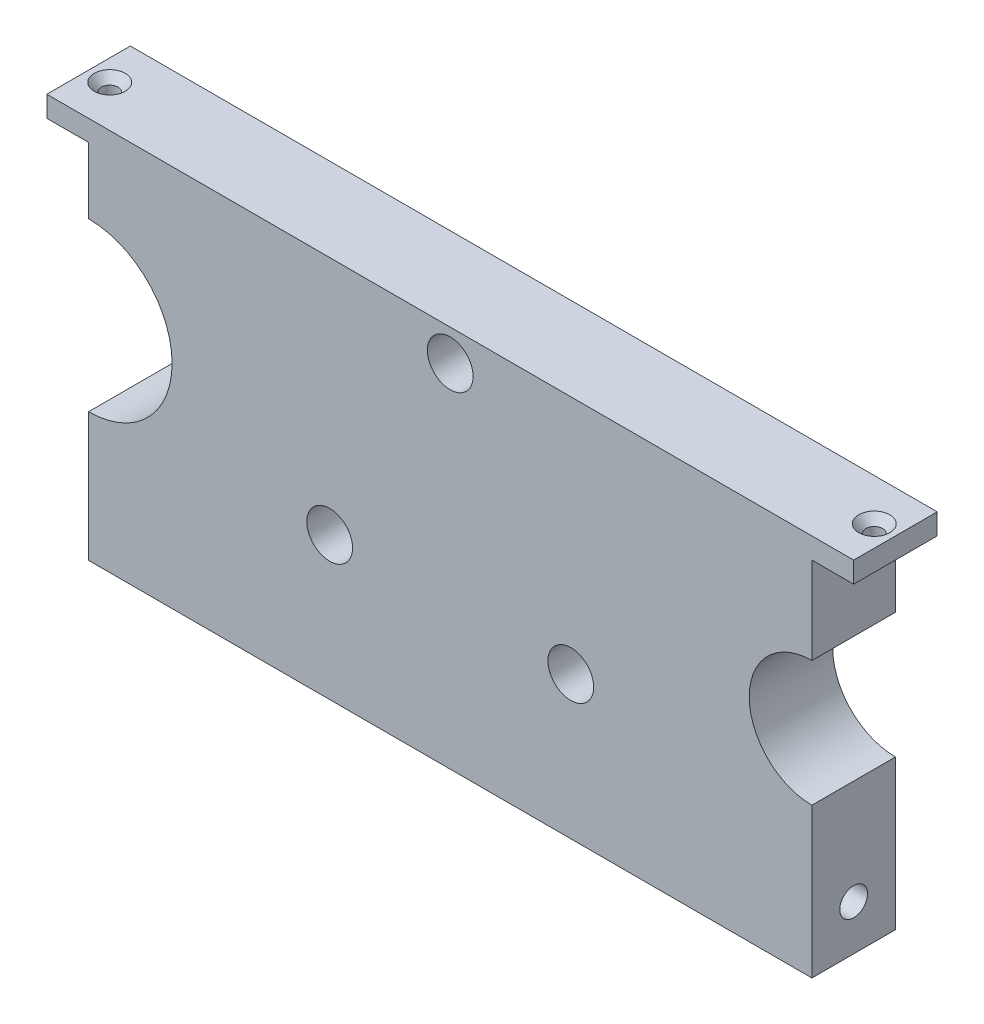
ISO-10303-21;
HEADER;
FILE_DESCRIPTION(('STEP AP214'),'2;1');
FILE_NAME('part.step','',(''),(''),'','','');
FILE_SCHEMA(('AUTOMOTIVE_DESIGN { 1 0 10303 214 1 1 1 1 }'));
ENDSEC;
DATA;
#1=APPLICATION_CONTEXT('core data for automotive mechanical design processes');
#2=APPLICATION_PROTOCOL_DEFINITION('international standard','automotive_design',2000,#1);
#3=PRODUCT_CONTEXT('',#1,'mechanical');
#4=PRODUCT('Part','Part','',(#3));
#5=PRODUCT_RELATED_PRODUCT_CATEGORY('part','',(#4));
#6=PRODUCT_DEFINITION_FORMATION('','',#4);
#7=PRODUCT_DEFINITION_CONTEXT('part definition',#1,'design');
#8=PRODUCT_DEFINITION('design','',#6,#7);
#9=PRODUCT_DEFINITION_SHAPE('','',#8);
#10=(LENGTH_UNIT() NAMED_UNIT(*) SI_UNIT(.MILLI.,.METRE.));
#11=(NAMED_UNIT(*) PLANE_ANGLE_UNIT() SI_UNIT($,.RADIAN.));
#12=(NAMED_UNIT(*) SI_UNIT($,.STERADIAN.) SOLID_ANGLE_UNIT());
#13=UNCERTAINTY_MEASURE_WITH_UNIT(LENGTH_MEASURE(1.E-05),#10,'distance_accuracy_value','');
#14=(GEOMETRIC_REPRESENTATION_CONTEXT(3) GLOBAL_UNCERTAINTY_ASSIGNED_CONTEXT((#13)) GLOBAL_UNIT_ASSIGNED_CONTEXT((#10,
#11,#12)) REPRESENTATION_CONTEXT('',''));
#15=CARTESIAN_POINT('',(0.,0.,0.));
#16=DIRECTION('',(0.,0.,1.));
#17=DIRECTION('',(1.,0.,0.));
#18=AXIS2_PLACEMENT_3D('',#15,#16,#17);
#19=CARTESIAN_POINT('',(-82.4865,0.,0.));
#20=DIRECTION('',(-1.,0.,0.));
#21=DIRECTION('',(0.,0.,1.));
#22=AXIS2_PLACEMENT_3D('',#19,#20,#21);
#23=PLANE('',#22);
#24=CARTESIAN_POINT('',(-82.4865,-38.10635,0.));
#25=DIRECTION('',(-1.,0.,0.));
#26=DIRECTION('',(0.,0.,1.));
#27=AXIS2_PLACEMENT_3D('',#24,#25,#26);
#28=CIRCLE('',#27,3.175);
#29=CARTESIAN_POINT('',(-82.4865,-38.10635,3.175));
#30=VERTEX_POINT('',#29);
#31=EDGE_CURVE('E150',#30,#30,#28,.T.);
#32=ORIENTED_EDGE('',*,*,#31,.F.);
#33=EDGE_LOOP('',(#32));
#34=FACE_BOUND('',#33,.T.);
#35=DIRECTION('',(0.,0.,1.));
#36=VECTOR('',#35,1.);
#37=CARTESIAN_POINT('',(-82.4865,-19.05,-9.525));
#38=LINE('',#37,#36);
#39=CARTESIAN_POINT('',(-82.4865,-19.05,-9.525));
#40=VERTEX_POINT('',#39);
#41=CARTESIAN_POINT('',(-82.4865,-19.05,9.525));
#42=VERTEX_POINT('',#41);
#43=EDGE_CURVE('E13',#40,#42,#38,.T.);
#44=ORIENTED_EDGE('',*,*,#43,.F.);
#45=DIRECTION('',(0.,1.,0.));
#46=VECTOR('',#45,1.);
#47=CARTESIAN_POINT('',(-82.4865,-48.41875,-9.525));
#48=LINE('',#47,#46);
#49=CARTESIAN_POINT('',(-82.4865,-48.41875,-9.525));
#50=VERTEX_POINT('',#49);
#51=EDGE_CURVE('E219',#50,#40,#48,.T.);
#52=ORIENTED_EDGE('',*,*,#51,.F.);
#53=DIRECTION('',(0.,0.,-1.));
#54=VECTOR('',#53,1.);
#55=CARTESIAN_POINT('',(-82.4865,-48.41875,9.525));
#56=LINE('',#55,#54);
#57=CARTESIAN_POINT('',(-82.4865,-48.41875,9.525));
#58=VERTEX_POINT('',#57);
#59=EDGE_CURVE('E228',#58,#50,#56,.T.);
#60=ORIENTED_EDGE('',*,*,#59,.F.);
#61=DIRECTION('',(0.,-1.,0.));
#62=VECTOR('',#61,1.);
#63=CARTESIAN_POINT('',(-82.4865,-48.41875,9.525));
#64=LINE('',#63,#62);
#65=EDGE_CURVE('E224',#42,#58,#64,.T.);
#66=ORIENTED_EDGE('',*,*,#65,.F.);
#67=EDGE_LOOP('',(#44,#52,#60,#66));
#68=FACE_BOUND('',#67,.T.);
#69=ADVANCED_FACE('F46',(#34,#68),#23,.T.);
#70=CARTESIAN_POINT('',(82.4865,0.,0.));
#71=DIRECTION('',(-1.,0.,0.));
#72=DIRECTION('',(0.,0.,1.));
#73=AXIS2_PLACEMENT_3D('',#70,#71,#72);
#74=PLANE('',#73);
#75=CARTESIAN_POINT('',(82.4865,-38.10635,0.));
#76=DIRECTION('',(1.,0.,0.));
#77=DIRECTION('',(0.,0.,-1.));
#78=AXIS2_PLACEMENT_3D('',#75,#76,#77);
#79=CIRCLE('',#78,3.175);
#80=CARTESIAN_POINT('',(82.4865,-38.10635,-3.175));
#81=VERTEX_POINT('',#80);
#82=EDGE_CURVE('E151',#81,#81,#79,.T.);
#83=ORIENTED_EDGE('',*,*,#82,.F.);
#84=EDGE_LOOP('',(#83));
#85=FACE_BOUND('',#84,.T.);
#86=DIRECTION('',(0.,1.,0.));
#87=VECTOR('',#86,1.);
#88=CARTESIAN_POINT('',(82.4865,-48.41875,-9.525));
#89=LINE('',#88,#87);
#90=CARTESIAN_POINT('',(82.4865,-48.41875,-9.525));
#91=VERTEX_POINT('',#90);
#92=CARTESIAN_POINT('',(82.4865,-14.2875,-9.525));
#93=VERTEX_POINT('',#92);
#94=EDGE_CURVE('E205',#91,#93,#89,.T.);
#95=ORIENTED_EDGE('',*,*,#94,.T.);
#96=DIRECTION('',(0.,0.,1.));
#97=VECTOR('',#96,1.);
#98=CARTESIAN_POINT('',(82.4865,-14.2875,-9.525));
#99=LINE('',#98,#97);
#100=CARTESIAN_POINT('',(82.4865,-14.2875,9.525));
#101=VERTEX_POINT('',#100);
#102=EDGE_CURVE('E237',#93,#101,#99,.T.);
#103=ORIENTED_EDGE('',*,*,#102,.T.);
#104=DIRECTION('',(0.,-1.,0.));
#105=VECTOR('',#104,1.);
#106=CARTESIAN_POINT('',(82.4865,-48.41875,9.525));
#107=LINE('',#106,#105);
#108=CARTESIAN_POINT('',(82.4865,-48.41875,9.525));
#109=VERTEX_POINT('',#108);
#110=EDGE_CURVE('E212',#101,#109,#107,.T.);
#111=ORIENTED_EDGE('',*,*,#110,.T.);
#112=DIRECTION('',(0.,0.,-1.));
#113=VECTOR('',#112,1.);
#114=CARTESIAN_POINT('',(82.4865,-48.41875,9.525));
#115=LINE('',#114,#113);
#116=EDGE_CURVE('E216',#109,#91,#115,.T.);
#117=ORIENTED_EDGE('',*,*,#116,.T.);
#118=EDGE_LOOP('',(#95,#103,#111,#117));
#119=FACE_BOUND('',#118,.T.);
#120=ADVANCED_FACE('F335',(#85,#119),#74,.F.);
#121=CARTESIAN_POINT('',(82.4865,-48.41875,-9.525));
#122=DIRECTION('',(0.,0.,1.));
#123=DIRECTION('',(1.,0.,0.));
#124=AXIS2_PLACEMENT_3D('',#121,#122,#123);
#125=PLANE('',#124);
#126=CARTESIAN_POINT('',(0.,31.75,-9.525));
#127=DIRECTION('',(0.,0.,1.));
#128=DIRECTION('',(1.,0.,0.));
#129=AXIS2_PLACEMENT_3D('',#126,#127,#128);
#130=CIRCLE('',#129,2.55270000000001);
#131=CARTESIAN_POINT('',(2.55270000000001,31.75,-9.525));
#132=VERTEX_POINT('',#131);
#133=EDGE_CURVE('E263',#132,#132,#130,.T.);
#134=ORIENTED_EDGE('',*,*,#133,.T.);
#135=EDGE_LOOP('',(#134));
#136=FACE_BOUND('',#135,.T.);
#137=CARTESIAN_POINT('',(27.4963065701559,-15.8750000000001,-9.525));
#138=DIRECTION('',(0.,0.,1.));
#139=DIRECTION('',(1.,0.,0.));
#140=AXIS2_PLACEMENT_3D('',#137,#138,#139);
#141=CIRCLE('',#140,2.55270000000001);
#142=CARTESIAN_POINT('',(30.0490065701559,-15.8750000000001,-9.525));
#143=VERTEX_POINT('',#142);
#144=EDGE_CURVE('E275',#143,#143,#141,.T.);
#145=ORIENTED_EDGE('',*,*,#144,.T.);
#146=EDGE_LOOP('',(#145));
#147=FACE_BOUND('',#146,.T.);
#148=CARTESIAN_POINT('',(-27.4963065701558,-15.8750000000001,-9.525));
#149=DIRECTION('',(0.,0.,1.));
#150=DIRECTION('',(1.,0.,0.));
#151=AXIS2_PLACEMENT_3D('',#148,#149,#150);
#152=CIRCLE('',#151,2.55270000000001);
#153=CARTESIAN_POINT('',(-24.9436065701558,-15.8750000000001,-9.525));
#154=VERTEX_POINT('',#153);
#155=EDGE_CURVE('E157',#154,#154,#152,.T.);
#156=ORIENTED_EDGE('',*,*,#155,.T.);
#157=EDGE_LOOP('',(#156));
#158=FACE_BOUND('',#157,.T.);
#159=ORIENTED_EDGE('',*,*,#51,.T.);
#160=CARTESIAN_POINT('',(-82.4865,0.,-9.525));
#161=DIRECTION('',(0.,0.,1.));
#162=DIRECTION('',(1.,0.,0.));
#163=AXIS2_PLACEMENT_3D('',#160,#161,#162);
#164=CIRCLE('',#163,19.05);
#165=CARTESIAN_POINT('',(-82.4865,19.05,-9.525));
#166=VERTEX_POINT('',#165);
#167=EDGE_CURVE('E198',#40,#166,#164,.T.);
#168=ORIENTED_EDGE('',*,*,#167,.T.);
#169=CARTESIAN_POINT('',(-82.4865,34.1312499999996,-9.525));
#170=VERTEX_POINT('',#169);
#171=EDGE_CURVE('E204',#166,#170,#48,.T.);
#172=ORIENTED_EDGE('',*,*,#171,.T.);
#173=DIRECTION('',(1.,0.,0.));
#174=VECTOR('',#173,1.);
#175=CARTESIAN_POINT('',(82.4865,34.13125,-9.525));
#176=LINE('',#175,#174);
#177=CARTESIAN_POINT('',(-92.0115,34.13125,-9.525));
#178=VERTEX_POINT('',#177);
#179=EDGE_CURVE('E180',#178,#170,#176,.T.);
#180=ORIENTED_EDGE('',*,*,#179,.F.);
#181=DIRECTION('',(0.,-1.,0.));
#182=VECTOR('',#181,1.);
#183=CARTESIAN_POINT('',(-92.0115,34.13125,-9.525));
#184=LINE('',#183,#182);
#185=CARTESIAN_POINT('',(-92.0115,38.89375,-9.525));
#186=VERTEX_POINT('',#185);
#187=EDGE_CURVE('E163',#186,#178,#184,.T.);
#188=ORIENTED_EDGE('',*,*,#187,.F.);
#189=DIRECTION('',(-1.,0.,0.));
#190=VECTOR('',#189,1.);
#191=CARTESIAN_POINT('',(-12.7,38.89375,-9.525));
#192=LINE('',#191,#190);
#193=CARTESIAN_POINT('',(92.0115,38.89375,-9.525));
#194=VERTEX_POINT('',#193);
#195=EDGE_CURVE('E167',#194,#186,#192,.T.);
#196=ORIENTED_EDGE('',*,*,#195,.F.);
#197=DIRECTION('',(0.,1.,0.));
#198=VECTOR('',#197,1.);
#199=CARTESIAN_POINT('',(92.0115,34.13125,-9.525));
#200=LINE('',#199,#198);
#201=CARTESIAN_POINT('',(92.0115,34.13125,-9.525));
#202=VERTEX_POINT('',#201);
#203=EDGE_CURVE('E182',#202,#194,#200,.T.);
#204=ORIENTED_EDGE('',*,*,#203,.F.);
#205=CARTESIAN_POINT('',(82.4865,34.13125,-9.525));
#206=VERTEX_POINT('',#205);
#207=EDGE_CURVE('E179',#206,#202,#176,.T.);
#208=ORIENTED_EDGE('',*,*,#207,.F.);
#209=CARTESIAN_POINT('',(82.4865,14.2875,-9.525));
#210=VERTEX_POINT('',#209);
#211=EDGE_CURVE('E209',#210,#206,#89,.T.);
#212=ORIENTED_EDGE('',*,*,#211,.F.);
#213=CARTESIAN_POINT('',(82.4865,0.,-9.525));
#214=DIRECTION('',(0.,0.,1.));
#215=DIRECTION('',(1.,0.,0.));
#216=AXIS2_PLACEMENT_3D('',#213,#214,#215);
#217=CIRCLE('',#216,14.2875);
#218=EDGE_CURVE('E70',#210,#93,#217,.T.);
#219=ORIENTED_EDGE('',*,*,#218,.T.);
#220=ORIENTED_EDGE('',*,*,#94,.F.);
#221=DIRECTION('',(-1.,0.,0.));
#222=VECTOR('',#221,1.);
#223=CARTESIAN_POINT('',(82.4865,-48.41875,-9.525));
#224=LINE('',#223,#222);
#225=EDGE_CURVE('E218',#91,#50,#224,.T.);
#226=ORIENTED_EDGE('',*,*,#225,.T.);
#227=EDGE_LOOP('',(#159,#168,#172,#180,#188,#196,#204,#208,#212,#219,#220,#226));
#228=FACE_BOUND('',#227,.T.);
#229=ADVANCED_FACE('F48',(#136,#147,#158,#228),#125,.F.);
#230=CARTESIAN_POINT('',(82.4865,-48.41875,9.525));
#231=DIRECTION('',(0.,0.,-1.));
#232=DIRECTION('',(-1.,0.,0.));
#233=AXIS2_PLACEMENT_3D('',#230,#231,#232);
#234=PLANE('',#233);
#235=CARTESIAN_POINT('',(0.,31.75,9.525));
#236=DIRECTION('',(0.,0.,1.));
#237=DIRECTION('',(1.,0.,0.));
#238=AXIS2_PLACEMENT_3D('',#235,#236,#237);
#239=CIRCLE('',#238,5.2197);
#240=CARTESIAN_POINT('',(5.2197,31.75,9.525));
#241=VERTEX_POINT('',#240);
#242=EDGE_CURVE('E242',#241,#241,#239,.T.);
#243=ORIENTED_EDGE('',*,*,#242,.F.);
#244=EDGE_LOOP('',(#243));
#245=FACE_BOUND('',#244,.T.);
#246=CARTESIAN_POINT('',(27.4963065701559,-15.8750000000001,9.525));
#247=DIRECTION('',(0.,0.,1.));
#248=DIRECTION('',(1.,0.,0.));
#249=AXIS2_PLACEMENT_3D('',#246,#247,#248);
#250=CIRCLE('',#249,5.2197);
#251=CARTESIAN_POINT('',(32.7160065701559,-15.8750000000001,9.525));
#252=VERTEX_POINT('',#251);
#253=EDGE_CURVE('E266',#252,#252,#250,.T.);
#254=ORIENTED_EDGE('',*,*,#253,.F.);
#255=EDGE_LOOP('',(#254));
#256=FACE_BOUND('',#255,.T.);
#257=CARTESIAN_POINT('',(-27.4963065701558,-15.8750000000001,9.525));
#258=DIRECTION('',(0.,0.,1.));
#259=DIRECTION('',(1.,0.,0.));
#260=AXIS2_PLACEMENT_3D('',#257,#258,#259);
#261=CIRCLE('',#260,5.2197);
#262=CARTESIAN_POINT('',(-22.2766065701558,-15.8750000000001,9.525));
#263=VERTEX_POINT('',#262);
#264=EDGE_CURVE('E278',#263,#263,#261,.T.);
#265=ORIENTED_EDGE('',*,*,#264,.F.);
#266=EDGE_LOOP('',(#265));
#267=FACE_BOUND('',#266,.T.);
#268=CARTESIAN_POINT('',(-82.4865,34.13125,9.525));
#269=VERTEX_POINT('',#268);
#270=CARTESIAN_POINT('',(-82.4865,19.05,9.525));
#271=VERTEX_POINT('',#270);
#272=EDGE_CURVE('E225',#269,#271,#64,.T.);
#273=ORIENTED_EDGE('',*,*,#272,.T.);
#274=CARTESIAN_POINT('',(-82.4865,0.,9.525));
#275=DIRECTION('',(0.,0.,1.));
#276=DIRECTION('',(1.,0.,0.));
#277=AXIS2_PLACEMENT_3D('',#274,#275,#276);
#278=CIRCLE('',#277,19.05);
#279=EDGE_CURVE('E62',#42,#271,#278,.T.);
#280=ORIENTED_EDGE('',*,*,#279,.F.);
#281=ORIENTED_EDGE('',*,*,#65,.T.);
#282=DIRECTION('',(-1.,0.,0.));
#283=VECTOR('',#282,1.);
#284=CARTESIAN_POINT('',(82.4865,-48.41875,9.525));
#285=LINE('',#284,#283);
#286=EDGE_CURVE('E232',#109,#58,#285,.T.);
#287=ORIENTED_EDGE('',*,*,#286,.F.);
#288=ORIENTED_EDGE('',*,*,#110,.F.);
#289=CARTESIAN_POINT('',(82.4865,0.,9.525));
#290=DIRECTION('',(0.,0.,1.));
#291=DIRECTION('',(1.,0.,0.));
#292=AXIS2_PLACEMENT_3D('',#289,#290,#291);
#293=CIRCLE('',#292,14.2875);
#294=CARTESIAN_POINT('',(82.4865,14.2875,9.525));
#295=VERTEX_POINT('',#294);
#296=EDGE_CURVE('E201',#295,#101,#293,.T.);
#297=ORIENTED_EDGE('',*,*,#296,.F.);
#298=CARTESIAN_POINT('',(82.4865,34.13125,9.525));
#299=VERTEX_POINT('',#298);
#300=EDGE_CURVE('E213',#299,#295,#107,.T.);
#301=ORIENTED_EDGE('',*,*,#300,.F.);
#302=DIRECTION('',(1.,0.,0.));
#303=VECTOR('',#302,1.);
#304=CARTESIAN_POINT('',(-82.4865,34.13125,9.525));
#305=LINE('',#304,#303);
#306=CARTESIAN_POINT('',(92.0115,34.13125,9.525));
#307=VERTEX_POINT('',#306);
#308=EDGE_CURVE('E169',#299,#307,#305,.T.);
#309=ORIENTED_EDGE('',*,*,#308,.T.);
#310=DIRECTION('',(0.,1.,0.));
#311=VECTOR('',#310,1.);
#312=CARTESIAN_POINT('',(92.0115,34.13125,9.525));
#313=LINE('',#312,#311);
#314=CARTESIAN_POINT('',(92.0115,38.89375,9.525));
#315=VERTEX_POINT('',#314);
#316=EDGE_CURVE('E173',#307,#315,#313,.T.);
#317=ORIENTED_EDGE('',*,*,#316,.T.);
#318=DIRECTION('',(-1.,0.,0.));
#319=VECTOR('',#318,1.);
#320=CARTESIAN_POINT('',(-82.4865,38.89375,9.525));
#321=LINE('',#320,#319);
#322=CARTESIAN_POINT('',(-92.0115,38.89375,9.525));
#323=VERTEX_POINT('',#322);
#324=EDGE_CURVE('E164',#315,#323,#321,.T.);
#325=ORIENTED_EDGE('',*,*,#324,.T.);
#326=DIRECTION('',(0.,-1.,0.));
#327=VECTOR('',#326,1.);
#328=CARTESIAN_POINT('',(-92.0115,34.13125,9.525));
#329=LINE('',#328,#327);
#330=CARTESIAN_POINT('',(-92.0115,34.13125,9.525));
#331=VERTEX_POINT('',#330);
#332=EDGE_CURVE('E166',#323,#331,#329,.T.);
#333=ORIENTED_EDGE('',*,*,#332,.T.);
#334=EDGE_CURVE('E170',#331,#269,#305,.T.);
#335=ORIENTED_EDGE('',*,*,#334,.T.);
#336=EDGE_LOOP('',(#273,#280,#281,#287,#288,#297,#301,#309,#317,#325,#333,#335));
#337=FACE_BOUND('',#336,.T.);
#338=ADVANCED_FACE('F310',(#245,#256,#267,#337),#234,.F.);
#339=CARTESIAN_POINT('',(82.4865,-48.41875,9.525));
#340=DIRECTION('',(0.,1.,0.));
#341=DIRECTION('',(0.,0.,1.));
#342=AXIS2_PLACEMENT_3D('',#339,#340,#341);
#343=PLANE('',#342);
#344=ORIENTED_EDGE('',*,*,#59,.T.);
#345=ORIENTED_EDGE('',*,*,#225,.F.);
#346=ORIENTED_EDGE('',*,*,#116,.F.);
#347=ORIENTED_EDGE('',*,*,#286,.T.);
#348=EDGE_LOOP('',(#344,#345,#346,#347));
#349=FACE_BOUND('',#348,.T.);
#350=ADVANCED_FACE('F313',(#349),#343,.F.);
#351=ORIENTED_EDGE('',*,*,#300,.T.);
#352=DIRECTION('',(0.,0.,1.));
#353=VECTOR('',#352,1.);
#354=CARTESIAN_POINT('',(82.4865,14.2875,-9.525));
#355=LINE('',#354,#353);
#356=EDGE_CURVE('E235',#295,#210,#355,.F.);
#357=ORIENTED_EDGE('',*,*,#356,.T.);
#358=ORIENTED_EDGE('',*,*,#211,.T.);
#359=DIRECTION('',(0.,0.,1.));
#360=VECTOR('',#359,1.);
#361=CARTESIAN_POINT('',(82.4865,34.13125,9.525));
#362=LINE('',#361,#360);
#363=EDGE_CURVE('E208',#206,#299,#362,.T.);
#364=ORIENTED_EDGE('',*,*,#363,.T.);
#365=EDGE_LOOP('',(#351,#357,#358,#364));
#366=FACE_BOUND('',#365,.T.);
#367=ADVANCED_FACE('F339',(#366),#74,.F.);
#368=DIRECTION('',(0.,0.,1.));
#369=VECTOR('',#368,1.);
#370=CARTESIAN_POINT('',(-82.4865,19.05,-9.525));
#371=LINE('',#370,#369);
#372=EDGE_CURVE('E55',#271,#166,#371,.F.);
#373=ORIENTED_EDGE('',*,*,#372,.F.);
#374=ORIENTED_EDGE('',*,*,#272,.F.);
#375=DIRECTION('',(0.,0.,1.));
#376=VECTOR('',#375,1.);
#377=CARTESIAN_POINT('',(-82.4865,34.13125,9.525));
#378=LINE('',#377,#376);
#379=EDGE_CURVE('E222',#170,#269,#378,.T.);
#380=ORIENTED_EDGE('',*,*,#379,.F.);
#381=ORIENTED_EDGE('',*,*,#171,.F.);
#382=EDGE_LOOP('',(#373,#374,#380,#381));
#383=FACE_BOUND('',#382,.T.);
#384=ADVANCED_FACE('F320',(#383),#23,.T.);
#385=CARTESIAN_POINT('',(82.4865,0.,-9.525));
#386=DIRECTION('',(0.,0.,1.));
#387=DIRECTION('',(1.,0.,0.));
#388=AXIS2_PLACEMENT_3D('',#385,#386,#387);
#389=CYLINDRICAL_SURFACE('',#388,14.2875);
#390=ORIENTED_EDGE('',*,*,#218,.F.);
#391=ORIENTED_EDGE('',*,*,#356,.F.);
#392=ORIENTED_EDGE('',*,*,#296,.T.);
#393=ORIENTED_EDGE('',*,*,#102,.F.);
#394=EDGE_LOOP('',(#390,#391,#392,#393));
#395=FACE_BOUND('',#394,.T.);
#396=ADVANCED_FACE('F369',(#395),#389,.F.);
#397=CARTESIAN_POINT('',(-82.4865,0.,-9.525));
#398=DIRECTION('',(0.,0.,1.));
#399=DIRECTION('',(1.,0.,0.));
#400=AXIS2_PLACEMENT_3D('',#397,#398,#399);
#401=CYLINDRICAL_SURFACE('',#400,19.05);
#402=ORIENTED_EDGE('',*,*,#43,.T.);
#403=ORIENTED_EDGE('',*,*,#279,.T.);
#404=ORIENTED_EDGE('',*,*,#372,.T.);
#405=ORIENTED_EDGE('',*,*,#167,.F.);
#406=EDGE_LOOP('',(#402,#403,#404,#405));
#407=FACE_BOUND('',#406,.T.);
#408=ADVANCED_FACE('F323',(#407),#401,.F.);
#409=CARTESIAN_POINT('',(82.4865,34.13125,9.525));
#410=DIRECTION('',(0.,1.,0.));
#411=DIRECTION('',(-1.,0.,0.));
#412=AXIS2_PLACEMENT_3D('',#409,#410,#411);
#413=PLANE('',#412);
#414=CARTESIAN_POINT('',(-87.1855,34.1312499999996,0.));
#415=DIRECTION('',(0.,1.,0.));
#416=DIRECTION('',(-1.,0.,0.));
#417=AXIS2_PLACEMENT_3D('',#414,#415,#416);
#418=CIRCLE('',#417,1.89864999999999);
#419=CARTESIAN_POINT('',(-89.08415,34.1312499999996,0.));
#420=VERTEX_POINT('',#419);
#421=EDGE_CURVE('E50',#420,#420,#418,.T.);
#422=ORIENTED_EDGE('',*,*,#421,.T.);
#423=EDGE_LOOP('',(#422));
#424=FACE_BOUND('',#423,.T.);
#425=ORIENTED_EDGE('',*,*,#179,.T.);
#426=ORIENTED_EDGE('',*,*,#379,.T.);
#427=ORIENTED_EDGE('',*,*,#334,.F.);
#428=DIRECTION('',(0.,0.,-1.));
#429=VECTOR('',#428,1.);
#430=CARTESIAN_POINT('',(-92.0115,34.13125,9.525));
#431=LINE('',#430,#429);
#432=EDGE_CURVE('E191',#331,#178,#431,.T.);
#433=ORIENTED_EDGE('',*,*,#432,.T.);
#434=EDGE_LOOP('',(#425,#426,#427,#433));
#435=FACE_BOUND('',#434,.T.);
#436=ADVANCED_FACE('F360',(#424,#435),#413,.F.);
#437=CARTESIAN_POINT('',(-92.0115,34.13125,9.525));
#438=DIRECTION('',(1.,0.,0.));
#439=DIRECTION('',(0.,0.,-1.));
#440=AXIS2_PLACEMENT_3D('',#437,#438,#439);
#441=PLANE('',#440);
#442=ORIENTED_EDGE('',*,*,#187,.T.);
#443=ORIENTED_EDGE('',*,*,#432,.F.);
#444=ORIENTED_EDGE('',*,*,#332,.F.);
#445=DIRECTION('',(0.,0.,-1.));
#446=VECTOR('',#445,1.);
#447=CARTESIAN_POINT('',(-92.0115,38.89375,9.525));
#448=LINE('',#447,#446);
#449=EDGE_CURVE('E194',#323,#186,#448,.T.);
#450=ORIENTED_EDGE('',*,*,#449,.T.);
#451=EDGE_LOOP('',(#442,#443,#444,#450));
#452=FACE_BOUND('',#451,.T.);
#453=ADVANCED_FACE('F358',(#452),#441,.F.);
#454=CARTESIAN_POINT('',(87.1855,34.13125,0.));
#455=DIRECTION('',(0.,1.,0.));
#456=DIRECTION('',(-1.,0.,0.));
#457=AXIS2_PLACEMENT_3D('',#454,#455,#456);
#458=CIRCLE('',#457,1.89864999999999);
#459=CARTESIAN_POINT('',(85.28685,34.13125,0.));
#460=VERTEX_POINT('',#459);
#461=EDGE_CURVE('E240',#460,#460,#458,.T.);
#462=ORIENTED_EDGE('',*,*,#461,.T.);
#463=EDGE_LOOP('',(#462));
#464=FACE_BOUND('',#463,.T.);
#465=ORIENTED_EDGE('',*,*,#363,.F.);
#466=ORIENTED_EDGE('',*,*,#207,.T.);
#467=DIRECTION('',(0.,0.,-1.));
#468=VECTOR('',#467,1.);
#469=CARTESIAN_POINT('',(92.0115,34.13125,9.525));
#470=LINE('',#469,#468);
#471=EDGE_CURVE('E188',#307,#202,#470,.T.);
#472=ORIENTED_EDGE('',*,*,#471,.F.);
#473=ORIENTED_EDGE('',*,*,#308,.F.);
#474=EDGE_LOOP('',(#465,#466,#472,#473));
#475=FACE_BOUND('',#474,.T.);
#476=ADVANCED_FACE('F344',(#464,#475),#413,.F.);
#477=CARTESIAN_POINT('',(92.0115,34.13125,9.525));
#478=DIRECTION('',(-1.,0.,0.));
#479=DIRECTION('',(0.,0.,1.));
#480=AXIS2_PLACEMENT_3D('',#477,#478,#479);
#481=PLANE('',#480);
#482=ORIENTED_EDGE('',*,*,#203,.T.);
#483=DIRECTION('',(0.,0.,-1.));
#484=VECTOR('',#483,1.);
#485=CARTESIAN_POINT('',(92.0115,38.89375,9.525));
#486=LINE('',#485,#484);
#487=EDGE_CURVE('E176',#315,#194,#486,.T.);
#488=ORIENTED_EDGE('',*,*,#487,.F.);
#489=ORIENTED_EDGE('',*,*,#316,.F.);
#490=ORIENTED_EDGE('',*,*,#471,.T.);
#491=EDGE_LOOP('',(#482,#488,#489,#490));
#492=FACE_BOUND('',#491,.T.);
#493=ADVANCED_FACE('F350',(#492),#481,.F.);
#494=CARTESIAN_POINT('',(-12.7,38.89375,9.525));
#495=DIRECTION('',(0.,-1.,0.));
#496=DIRECTION('',(0.,0.,-1.));
#497=AXIS2_PLACEMENT_3D('',#494,#495,#496);
#498=PLANE('',#497);
#499=CARTESIAN_POINT('',(-87.1855,38.89375,0.));
#500=DIRECTION('',(0.,1.,0.));
#501=DIRECTION('',(0.,0.,1.));
#502=AXIS2_PLACEMENT_3D('',#499,#500,#501);
#503=CIRCLE('',#502,3.5433);
#504=CARTESIAN_POINT('',(-87.1855,38.89375,3.5433));
#505=VERTEX_POINT('',#504);
#506=EDGE_CURVE('E617',#505,#505,#503,.T.);
#507=ORIENTED_EDGE('',*,*,#506,.F.);
#508=EDGE_LOOP('',(#507));
#509=FACE_BOUND('',#508,.T.);
#510=CARTESIAN_POINT('',(87.1855,38.89375,0.));
#511=DIRECTION('',(0.,1.,0.));
#512=DIRECTION('',(0.,0.,1.));
#513=AXIS2_PLACEMENT_3D('',#510,#511,#512);
#514=CIRCLE('',#513,3.5433);
#515=CARTESIAN_POINT('',(87.1855,38.89375,3.5433));
#516=VERTEX_POINT('',#515);
#517=EDGE_CURVE('E250',#516,#516,#514,.T.);
#518=ORIENTED_EDGE('',*,*,#517,.F.);
#519=EDGE_LOOP('',(#518));
#520=FACE_BOUND('',#519,.T.);
#521=ORIENTED_EDGE('',*,*,#195,.T.);
#522=ORIENTED_EDGE('',*,*,#449,.F.);
#523=ORIENTED_EDGE('',*,*,#324,.F.);
#524=ORIENTED_EDGE('',*,*,#487,.T.);
#525=EDGE_LOOP('',(#521,#522,#523,#524));
#526=FACE_BOUND('',#525,.T.);
#527=ADVANCED_FACE('F353',(#509,#520,#526),#498,.F.);
#528=CARTESIAN_POINT('',(-72.9615,-38.10635,0.));
#529=DIRECTION('',(-1.,0.,0.));
#530=DIRECTION('',(0.,0.,1.));
#531=AXIS2_PLACEMENT_3D('',#528,#529,#530);
#532=CONICAL_SURFACE('',#531,3.175,1.02974425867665);
#533=CARTESIAN_POINT('',(-71.0537675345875,-38.10635,0.));
#534=VERTEX_POINT('',#533);
#535=VERTEX_LOOP('',#534);
#536=FACE_BOUND('',#535,.T.);
#537=CARTESIAN_POINT('',(-72.9615,-38.10635,0.));
#538=DIRECTION('',(-1.,0.,0.));
#539=DIRECTION('',(0.,0.,1.));
#540=AXIS2_PLACEMENT_3D('',#537,#538,#539);
#541=CIRCLE('',#540,3.175);
#542=CARTESIAN_POINT('',(-72.9615,-38.10635,3.175));
#543=VERTEX_POINT('',#542);
#544=EDGE_CURVE('E154',#543,#543,#541,.T.);
#545=ORIENTED_EDGE('',*,*,#544,.T.);
#546=EDGE_LOOP('',(#545));
#547=FACE_BOUND('',#546,.T.);
#548=ADVANCED_FACE('F441',(#536,#547),#532,.F.);
#549=CARTESIAN_POINT('',(-82.4865,-38.10635,0.));
#550=DIRECTION('',(-1.,0.,0.));
#551=DIRECTION('',(0.,0.,1.));
#552=AXIS2_PLACEMENT_3D('',#549,#550,#551);
#553=CYLINDRICAL_SURFACE('',#552,3.175);
#554=ORIENTED_EDGE('',*,*,#544,.F.);
#555=EDGE_LOOP('',(#554));
#556=FACE_BOUND('',#555,.T.);
#557=ORIENTED_EDGE('',*,*,#31,.T.);
#558=EDGE_LOOP('',(#557));
#559=FACE_BOUND('',#558,.T.);
#560=ADVANCED_FACE('F144',(#556,#559),#553,.F.);
#561=CARTESIAN_POINT('',(72.9615,-38.10635,0.));
#562=DIRECTION('',(1.,0.,0.));
#563=DIRECTION('',(0.,0.,-1.));
#564=AXIS2_PLACEMENT_3D('',#561,#562,#563);
#565=CONICAL_SURFACE('',#564,3.175,1.02974425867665);
#566=CARTESIAN_POINT('',(71.0537675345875,-38.10635,0.));
#567=VERTEX_POINT('',#566);
#568=VERTEX_LOOP('',#567);
#569=FACE_BOUND('',#568,.T.);
#570=CARTESIAN_POINT('',(72.9615,-38.10635,0.));
#571=DIRECTION('',(1.,0.,0.));
#572=DIRECTION('',(0.,0.,-1.));
#573=AXIS2_PLACEMENT_3D('',#570,#571,#572);
#574=CIRCLE('',#573,3.175);
#575=CARTESIAN_POINT('',(72.9615,-38.10635,-3.175));
#576=VERTEX_POINT('',#575);
#577=EDGE_CURVE('E148',#576,#576,#574,.T.);
#578=ORIENTED_EDGE('',*,*,#577,.T.);
#579=EDGE_LOOP('',(#578));
#580=FACE_BOUND('',#579,.T.);
#581=ADVANCED_FACE('F140',(#569,#580),#565,.F.);
#582=CARTESIAN_POINT('',(82.4865,-38.10635,0.));
#583=DIRECTION('',(1.,0.,0.));
#584=DIRECTION('',(0.,0.,-1.));
#585=AXIS2_PLACEMENT_3D('',#582,#583,#584);
#586=CYLINDRICAL_SURFACE('',#585,3.175);
#587=ORIENTED_EDGE('',*,*,#577,.F.);
#588=EDGE_LOOP('',(#587));
#589=FACE_BOUND('',#588,.T.);
#590=ORIENTED_EDGE('',*,*,#82,.T.);
#591=EDGE_LOOP('',(#590));
#592=FACE_BOUND('',#591,.T.);
#593=ADVANCED_FACE('F143',(#589,#592),#586,.F.);
#594=CARTESIAN_POINT('',(-27.4963065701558,-15.8750000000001,9.525));
#595=DIRECTION('',(0.,0.,1.));
#596=DIRECTION('',(1.,0.,0.));
#597=AXIS2_PLACEMENT_3D('',#594,#595,#596);
#598=CYLINDRICAL_SURFACE('',#597,2.5527);
#599=ORIENTED_EDGE('',*,*,#155,.F.);
#600=EDGE_LOOP('',(#599));
#601=FACE_BOUND('',#600,.T.);
#602=CARTESIAN_POINT('',(-27.4963065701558,-15.8750000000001,-6.24303254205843));
#603=DIRECTION('',(0.,0.,1.));
#604=DIRECTION('',(1.,0.,0.));
#605=AXIS2_PLACEMENT_3D('',#602,#603,#604);
#606=CIRCLE('',#605,2.5527);
#607=CARTESIAN_POINT('',(-24.9436065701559,-15.8750000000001,-6.24303254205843));
#608=VERTEX_POINT('',#607);
#609=EDGE_CURVE('E284',#608,#608,#606,.T.);
#610=ORIENTED_EDGE('',*,*,#609,.T.);
#611=EDGE_LOOP('',(#610));
#612=FACE_BOUND('',#611,.T.);
#613=ADVANCED_FACE('F291',(#601,#612),#598,.F.);
#614=CARTESIAN_POINT('',(-27.4963065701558,-15.8750000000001,-3.175));
#615=DIRECTION('',(0.,0.,1.));
#616=DIRECTION('',(1.,0.,0.));
#617=AXIS2_PLACEMENT_3D('',#614,#615,#616);
#618=CONICAL_SURFACE('',#617,5.2197,0.715584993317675);
#619=ORIENTED_EDGE('',*,*,#609,.F.);
#620=EDGE_LOOP('',(#619));
#621=FACE_BOUND('',#620,.T.);
#622=CARTESIAN_POINT('',(-27.4963065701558,-15.8750000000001,-3.175));
#623=DIRECTION('',(0.,0.,1.));
#624=DIRECTION('',(1.,0.,0.));
#625=AXIS2_PLACEMENT_3D('',#622,#623,#624);
#626=CIRCLE('',#625,5.2197);
#627=CARTESIAN_POINT('',(-22.2766065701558,-15.8750000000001,-3.175));
#628=VERTEX_POINT('',#627);
#629=EDGE_CURVE('E281',#628,#628,#626,.T.);
#630=ORIENTED_EDGE('',*,*,#629,.T.);
#631=EDGE_LOOP('',(#630));
#632=FACE_BOUND('',#631,.T.);
#633=ADVANCED_FACE('F294',(#621,#632),#618,.F.);
#634=CARTESIAN_POINT('',(-27.4963065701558,-15.8750000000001,9.525));
#635=DIRECTION('',(0.,0.,1.));
#636=DIRECTION('',(1.,0.,0.));
#637=AXIS2_PLACEMENT_3D('',#634,#635,#636);
#638=CYLINDRICAL_SURFACE('',#637,5.2197);
#639=ORIENTED_EDGE('',*,*,#629,.F.);
#640=EDGE_LOOP('',(#639));
#641=FACE_BOUND('',#640,.T.);
#642=ORIENTED_EDGE('',*,*,#264,.T.);
#643=EDGE_LOOP('',(#642));
#644=FACE_BOUND('',#643,.T.);
#645=ADVANCED_FACE('F300',(#641,#644),#638,.F.);
#646=CARTESIAN_POINT('',(27.4963065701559,-15.8750000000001,9.525));
#647=DIRECTION('',(0.,0.,1.));
#648=DIRECTION('',(1.,0.,0.));
#649=AXIS2_PLACEMENT_3D('',#646,#647,#648);
#650=CYLINDRICAL_SURFACE('',#649,2.5527);
#651=ORIENTED_EDGE('',*,*,#144,.F.);
#652=EDGE_LOOP('',(#651));
#653=FACE_BOUND('',#652,.T.);
#654=CARTESIAN_POINT('',(27.4963065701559,-15.8750000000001,-6.24303254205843));
#655=DIRECTION('',(0.,0.,1.));
#656=DIRECTION('',(1.,0.,0.));
#657=AXIS2_PLACEMENT_3D('',#654,#655,#656);
#658=CIRCLE('',#657,2.5527);
#659=CARTESIAN_POINT('',(30.0490065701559,-15.8750000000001,-6.24303254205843));
#660=VERTEX_POINT('',#659);
#661=EDGE_CURVE('E272',#660,#660,#658,.T.);
#662=ORIENTED_EDGE('',*,*,#661,.T.);
#663=EDGE_LOOP('',(#662));
#664=FACE_BOUND('',#663,.T.);
#665=ADVANCED_FACE('F306',(#653,#664),#650,.F.);
#666=CARTESIAN_POINT('',(27.4963065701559,-15.8750000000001,-3.175));
#667=DIRECTION('',(0.,0.,1.));
#668=DIRECTION('',(1.,0.,0.));
#669=AXIS2_PLACEMENT_3D('',#666,#667,#668);
#670=CONICAL_SURFACE('',#669,5.2197,0.715584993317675);
#671=ORIENTED_EDGE('',*,*,#661,.F.);
#672=EDGE_LOOP('',(#671));
#673=FACE_BOUND('',#672,.T.);
#674=CARTESIAN_POINT('',(27.4963065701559,-15.8750000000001,-3.175));
#675=DIRECTION('',(0.,0.,1.));
#676=DIRECTION('',(1.,0.,0.));
#677=AXIS2_PLACEMENT_3D('',#674,#675,#676);
#678=CIRCLE('',#677,5.2197);
#679=CARTESIAN_POINT('',(32.7160065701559,-15.8750000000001,-3.175));
#680=VERTEX_POINT('',#679);
#681=EDGE_CURVE('E269',#680,#680,#678,.T.);
#682=ORIENTED_EDGE('',*,*,#681,.T.);
#683=EDGE_LOOP('',(#682));
#684=FACE_BOUND('',#683,.T.);
#685=ADVANCED_FACE('F555',(#673,#684),#670,.F.);
#686=CARTESIAN_POINT('',(27.4963065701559,-15.8750000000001,9.525));
#687=DIRECTION('',(0.,0.,1.));
#688=DIRECTION('',(1.,0.,0.));
#689=AXIS2_PLACEMENT_3D('',#686,#687,#688);
#690=CYLINDRICAL_SURFACE('',#689,5.2197);
#691=ORIENTED_EDGE('',*,*,#681,.F.);
#692=EDGE_LOOP('',(#691));
#693=FACE_BOUND('',#692,.T.);
#694=ORIENTED_EDGE('',*,*,#253,.T.);
#695=EDGE_LOOP('',(#694));
#696=FACE_BOUND('',#695,.T.);
#697=ADVANCED_FACE('F545',(#693,#696),#690,.F.);
#698=CARTESIAN_POINT('',(0.,31.75,9.525));
#699=DIRECTION('',(0.,0.,1.));
#700=DIRECTION('',(1.,0.,0.));
#701=AXIS2_PLACEMENT_3D('',#698,#699,#700);
#702=CYLINDRICAL_SURFACE('',#701,2.5527);
#703=ORIENTED_EDGE('',*,*,#133,.F.);
#704=EDGE_LOOP('',(#703));
#705=FACE_BOUND('',#704,.T.);
#706=CARTESIAN_POINT('',(0.,31.75,-6.24303254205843));
#707=DIRECTION('',(0.,0.,1.));
#708=DIRECTION('',(1.,0.,0.));
#709=AXIS2_PLACEMENT_3D('',#706,#707,#708);
#710=CIRCLE('',#709,2.5527);
#711=CARTESIAN_POINT('',(2.5527,31.75,-6.24303254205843));
#712=VERTEX_POINT('',#711);
#713=EDGE_CURVE('E260',#712,#712,#710,.T.);
#714=ORIENTED_EDGE('',*,*,#713,.T.);
#715=EDGE_LOOP('',(#714));
#716=FACE_BOUND('',#715,.T.);
#717=ADVANCED_FACE('F535',(#705,#716),#702,.F.);
#718=CARTESIAN_POINT('',(0.,31.75,-3.175));
#719=DIRECTION('',(0.,0.,1.));
#720=DIRECTION('',(1.,0.,0.));
#721=AXIS2_PLACEMENT_3D('',#718,#719,#720);
#722=CONICAL_SURFACE('',#721,5.2197,0.715584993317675);
#723=ORIENTED_EDGE('',*,*,#713,.F.);
#724=EDGE_LOOP('',(#723));
#725=FACE_BOUND('',#724,.T.);
#726=CARTESIAN_POINT('',(0.,31.75,-3.175));
#727=DIRECTION('',(0.,0.,1.));
#728=DIRECTION('',(1.,0.,0.));
#729=AXIS2_PLACEMENT_3D('',#726,#727,#728);
#730=CIRCLE('',#729,5.2197);
#731=CARTESIAN_POINT('',(5.2197,31.75,-3.175));
#732=VERTEX_POINT('',#731);
#733=EDGE_CURVE('E247',#732,#732,#730,.T.);
#734=ORIENTED_EDGE('',*,*,#733,.T.);
#735=EDGE_LOOP('',(#734));
#736=FACE_BOUND('',#735,.T.);
#737=ADVANCED_FACE('F523',(#725,#736),#722,.F.);
#738=CARTESIAN_POINT('',(0.,31.75,9.525));
#739=DIRECTION('',(0.,0.,1.));
#740=DIRECTION('',(1.,0.,0.));
#741=AXIS2_PLACEMENT_3D('',#738,#739,#740);
#742=CYLINDRICAL_SURFACE('',#741,5.2197);
#743=ORIENTED_EDGE('',*,*,#733,.F.);
#744=EDGE_LOOP('',(#743));
#745=FACE_BOUND('',#744,.T.);
#746=ORIENTED_EDGE('',*,*,#242,.T.);
#747=EDGE_LOOP('',(#746));
#748=FACE_BOUND('',#747,.T.);
#749=ADVANCED_FACE('F517',(#745,#748),#742,.F.);
#750=CARTESIAN_POINT('',(87.1855,38.89375,0.));
#751=DIRECTION('',(0.,1.,0.));
#752=DIRECTION('',(0.,0.,1.));
#753=AXIS2_PLACEMENT_3D('',#750,#751,#752);
#754=CYLINDRICAL_SURFACE('',#753,1.89864999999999);
#755=CARTESIAN_POINT('',(87.1855,37.001796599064,0.));
#756=DIRECTION('',(0.,1.,0.));
#757=DIRECTION('',(0.,0.,1.));
#758=AXIS2_PLACEMENT_3D('',#755,#756,#757);
#759=CIRCLE('',#758,1.89865);
#760=CARTESIAN_POINT('',(87.1855,37.001796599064,1.89865));
#761=VERTEX_POINT('',#760);
#762=EDGE_CURVE('E243',#761,#761,#759,.T.);
#763=ORIENTED_EDGE('',*,*,#762,.T.);
#764=EDGE_LOOP('',(#763));
#765=FACE_BOUND('',#764,.T.);
#766=ORIENTED_EDGE('',*,*,#461,.F.);
#767=EDGE_LOOP('',(#766));
#768=FACE_BOUND('',#767,.T.);
#769=ADVANCED_FACE('F522',(#765,#768),#754,.F.);
#770=CARTESIAN_POINT('',(87.1855,38.89375,0.));
#771=DIRECTION('',(0.,1.,0.));
#772=DIRECTION('',(0.,0.,1.));
#773=AXIS2_PLACEMENT_3D('',#770,#771,#772);
#774=CONICAL_SURFACE('',#773,3.5433,0.715584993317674);
#775=ORIENTED_EDGE('',*,*,#762,.F.);
#776=EDGE_LOOP('',(#775));
#777=FACE_BOUND('',#776,.T.);
#778=ORIENTED_EDGE('',*,*,#517,.T.);
#779=EDGE_LOOP('',(#778));
#780=FACE_BOUND('',#779,.T.);
#781=ADVANCED_FACE('F598',(#777,#780),#774,.F.);
#782=CARTESIAN_POINT('',(-87.1855,38.89375,0.));
#783=DIRECTION('',(0.,1.,0.));
#784=DIRECTION('',(0.,0.,1.));
#785=AXIS2_PLACEMENT_3D('',#782,#783,#784);
#786=CYLINDRICAL_SURFACE('',#785,1.89864999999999);
#787=CARTESIAN_POINT('',(-87.1855,37.001796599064,0.));
#788=DIRECTION('',(0.,1.,0.));
#789=DIRECTION('',(0.,0.,1.));
#790=AXIS2_PLACEMENT_3D('',#787,#788,#789);
#791=CIRCLE('',#790,1.89865);
#792=CARTESIAN_POINT('',(-87.1855,37.001796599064,1.89865));
#793=VERTEX_POINT('',#792);
#794=EDGE_CURVE('E614',#793,#793,#791,.T.);
#795=ORIENTED_EDGE('',*,*,#794,.T.);
#796=EDGE_LOOP('',(#795));
#797=FACE_BOUND('',#796,.T.);
#798=ORIENTED_EDGE('',*,*,#421,.F.);
#799=EDGE_LOOP('',(#798));
#800=FACE_BOUND('',#799,.T.);
#801=ADVANCED_FACE('F601',(#797,#800),#786,.F.);
#802=CARTESIAN_POINT('',(-87.1855,38.89375,0.));
#803=DIRECTION('',(0.,1.,0.));
#804=DIRECTION('',(0.,0.,1.));
#805=AXIS2_PLACEMENT_3D('',#802,#803,#804);
#806=CONICAL_SURFACE('',#805,3.5433,0.715584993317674);
#807=ORIENTED_EDGE('',*,*,#794,.F.);
#808=EDGE_LOOP('',(#807));
#809=FACE_BOUND('',#808,.T.);
#810=ORIENTED_EDGE('',*,*,#506,.T.);
#811=EDGE_LOOP('',(#810));
#812=FACE_BOUND('',#811,.T.);
#813=ADVANCED_FACE('F605',(#809,#812),#806,.F.);
#814=CLOSED_SHELL('',(#69,#120,#229,#338,#350,#367,#384,#396,#408,#436,#453,#476,#493,#527,#548,
#560,#581,#593,#613,#633,#645,#665,#685,#697,#717,#737,#749,#769,#781,#801,#813));
#815=MANIFOLD_SOLID_BREP('B2',#814);
#816=ADVANCED_BREP_SHAPE_REPRESENTATION('',(#18,#815),#14);
#817=SHAPE_DEFINITION_REPRESENTATION(#9,#816);
ENDSEC;
END-ISO-10303-21;
